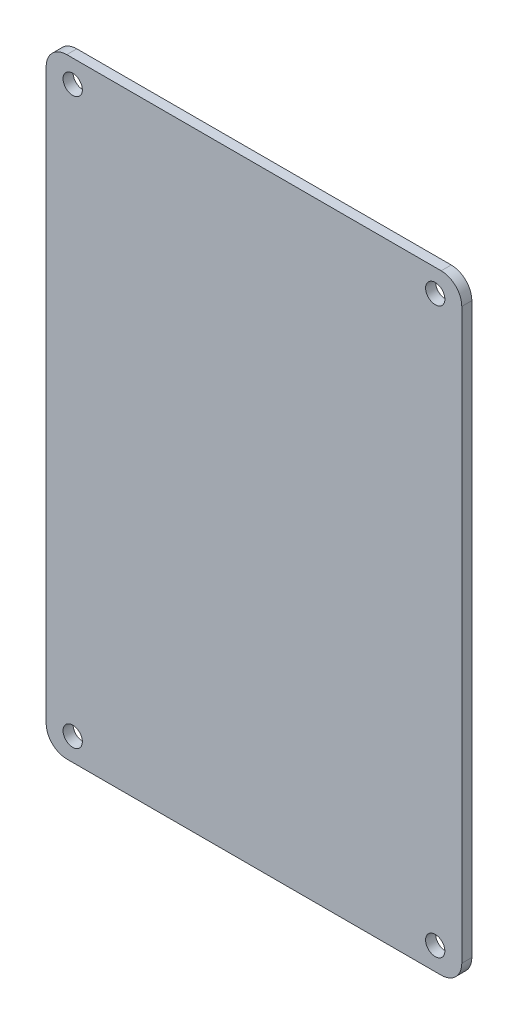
from build123d import *

# Parameters (mm, degrees)
SKETCH1_W           = 64.0588
SKETCH1_H           = 94.0308
SKETCH1_R           = 1.4859
BOSS_EXTRUDE1_DEPTH = 0.7747
FILLET1_R           = 3.175


with BuildPart() as part:
    # Sketch1 → Boss-Extrude1 (new, symmetric)
    with BuildSketch(Plane.XY):
        Rectangle(SKETCH1_W, SKETCH1_H)
        with Locations((27.94, 43.5102)):
            Circle(SKETCH1_R, mode=Mode.SUBTRACT)
        with Locations((-27.94, 43.5102)):
            Circle(SKETCH1_R, mode=Mode.SUBTRACT)
        with Locations((-27.94, -43.5102)):
            Circle(SKETCH1_R, mode=Mode.SUBTRACT)
        with Locations((27.94, -43.5102)):
            Circle(SKETCH1_R, mode=Mode.SUBTRACT)
    extrude(amount=BOSS_EXTRUDE1_DEPTH, both=True)

    # Fillet1
    fillet1_edges = [part.edges().sort_by_distance(p)[0] for p in [
        (32.0294, -47.0154, 0),
        (-32.0294, -47.0154, 0),
        (-32.0294, 47.0154, 0),
        (32.0294, 47.0154, 0),
    ]]
    fillet(fillet1_edges, radius=FILLET1_R)


solid = part.part
